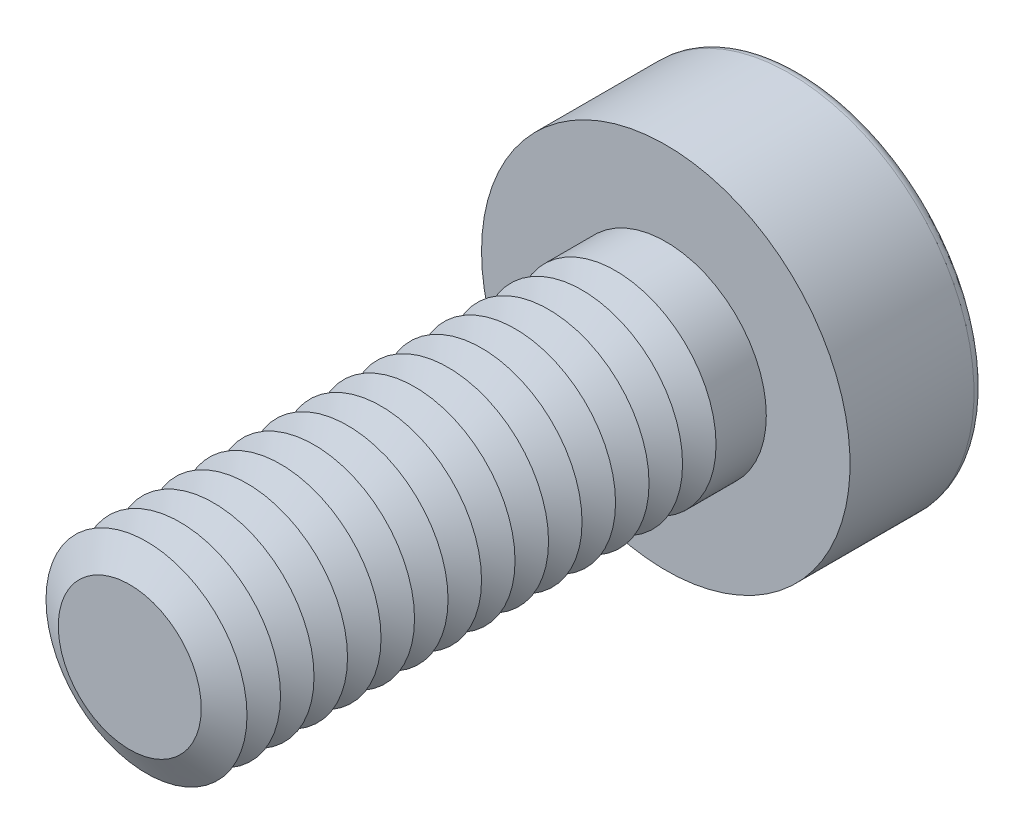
from build123d import *

# Parameters (mm, degrees)
SKETCH1_R           = 1.5
BOSS_EXTRUDE1_DEPTH = 8
SKETCH2_R           = 2.75
BOSS_EXTRUDE2_DEPTH = 2
CUT_EXTRUDE1_DEPTH  = 1.5
FILLET1_R           = 0.15
LPATTERN1_COUNT     = 15
LPATTERN1_PITCH     = 0.5


with BuildPart() as part:
    # Sketch1 → Boss-Extrude1 (new body)
    with BuildSketch(Plane.XY):
        Circle(SKETCH1_R)
    extrude(amount=BOSS_EXTRUDE1_DEPTH)

    # Sketch2 → Boss-Extrude2 (add)
    with BuildSketch(Plane(origin=(0, 0, 0), x_dir=(-1, 0, 0), z_dir=(0, 0, -1))):
        Circle(SKETCH2_R)
    extrude(amount=BOSS_EXTRUDE2_DEPTH)

    # Sketch3 → Cut-Extrude1 (cut)
    with BuildSketch(Plane(origin=(0, 0, -2), x_dir=(-1, 0, 0), z_dir=(0, 0, -1))):
        Polygon((-0.577350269, 1), (-1.154700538, 0), (-0.577350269, -1), (0.577350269, -1), (1.154700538, 0), (0.577350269, 1), align=None)
    extrude(amount=-CUT_EXTRUDE1_DEPTH, mode=Mode.SUBTRACT)

    # Fillet1
    fillet1_edges = [part.edges().sort_by_distance(p)[0] for p in [
        (2.75, 0, -2),
    ]]
    fillet(fillet1_edges, radius=FILLET1_R)

    # Cut-Extrude2 cone 1 section (on through the dimple's axis) → Cut-Extrude2 (revolve, cut)
    with BuildSketch(Plane(origin=(0, 0, -0.5), x_dir=(0, 1, 0), z_dir=(1, 0, 0))):
        Polygon((0, 0), (1, 0), (0, 0.577350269), align=None)
    revolve(axis=Axis((0, 0, -0.5), (0, 0, 1)), mode=Mode.SUBTRACT)

    # Cut-Extrude3 cone 1 section (on through the dimple's axis) → Cut-Extrude3 (revolve, cut)
    with BuildSketch(Plane(origin=(0, 0, -2), x_dir=(0, 1, 0), z_dir=(1, 0, 0))):
        Polygon((0, 0), (1.154700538, 0), (0, 0.309401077), align=None)
    revolve(axis=Axis((0, 0, -2), (0, 0, 1)), mode=Mode.SUBTRACT)

    # Sketch7 → Cut-Revolve1 (revolve, cut)
    with BuildSketch(Plane(origin=(0, 0, 0), x_dir=(0, 0, -1), z_dir=(1, 0, 0)), mode=Mode.PRIVATE) as cut_revolve1_sk:
        Polygon((-8, 1.066987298), (-7.75, 1.5), (-8.25, 1.5), align=None)
    cut_revolve1 = revolve(cut_revolve1_sk.sketch.rotate(Axis((0, 0, 8), (0, 0, -1)), 90), axis=Axis((0, 0, 8), (0, 0, -1)), mode=Mode.SUBTRACT)

    # LPattern1: Cut-Revolve1 ×15
    with Locations(*[(0, 0, -i * LPATTERN1_PITCH) for i in range(1, LPATTERN1_COUNT)]):
        add(cut_revolve1, mode=Mode.SUBTRACT)


solid = part.part
